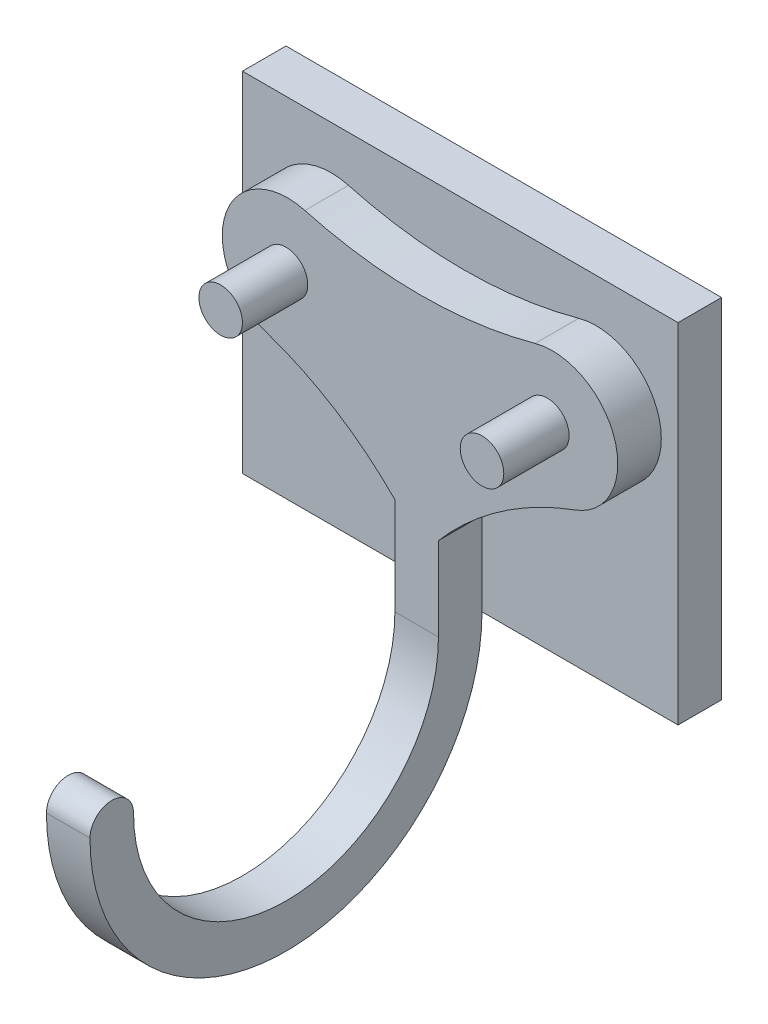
ISO-10303-21;
HEADER;
FILE_DESCRIPTION(('STEP AP214'),'2;1');
FILE_NAME('part.step','',(''),(''),'','','');
FILE_SCHEMA(('AUTOMOTIVE_DESIGN { 1 0 10303 214 1 1 1 1 }'));
ENDSEC;
DATA;
#1=APPLICATION_CONTEXT('core data for automotive mechanical design processes');
#2=APPLICATION_PROTOCOL_DEFINITION('international standard','automotive_design',2000,#1);
#3=PRODUCT_CONTEXT('',#1,'mechanical');
#4=PRODUCT('Part','Part','',(#3));
#5=PRODUCT_RELATED_PRODUCT_CATEGORY('part','',(#4));
#6=PRODUCT_DEFINITION_FORMATION('','',#4);
#7=PRODUCT_DEFINITION_CONTEXT('part definition',#1,'design');
#8=PRODUCT_DEFINITION('design','',#6,#7);
#9=PRODUCT_DEFINITION_SHAPE('','',#8);
#10=(LENGTH_UNIT() NAMED_UNIT(*) SI_UNIT(.MILLI.,.METRE.));
#11=(NAMED_UNIT(*) PLANE_ANGLE_UNIT() SI_UNIT($,.RADIAN.));
#12=(NAMED_UNIT(*) SI_UNIT($,.STERADIAN.) SOLID_ANGLE_UNIT());
#13=UNCERTAINTY_MEASURE_WITH_UNIT(LENGTH_MEASURE(1.E-05),#10,'distance_accuracy_value','');
#14=(GEOMETRIC_REPRESENTATION_CONTEXT(3) GLOBAL_UNCERTAINTY_ASSIGNED_CONTEXT((#13)) GLOBAL_UNIT_ASSIGNED_CONTEXT((#10,
#11,#12)) REPRESENTATION_CONTEXT('',''));
#15=CARTESIAN_POINT('',(0.,0.,0.));
#16=DIRECTION('',(0.,0.,1.));
#17=DIRECTION('',(1.,0.,0.));
#18=AXIS2_PLACEMENT_3D('',#15,#16,#17);
#19=CARTESIAN_POINT('',(-10.,-8.,2.));
#20=DIRECTION('',(0.,1.,0.));
#21=DIRECTION('',(0.,0.,1.));
#22=AXIS2_PLACEMENT_3D('',#19,#20,#21);
#23=PLANE('',#22);
#24=DIRECTION('',(-1.,0.,0.));
#25=VECTOR('',#24,1.);
#26=CARTESIAN_POINT('',(1.,-8.,2.));
#27=LINE('',#26,#25);
#28=CARTESIAN_POINT('',(1.,-8.,2.));
#29=VERTEX_POINT('',#28);
#30=CARTESIAN_POINT('',(-1.,-8.,2.));
#31=VERTEX_POINT('',#30);
#32=EDGE_CURVE('E168',#29,#31,#27,.T.);
#33=ORIENTED_EDGE('',*,*,#32,.T.);
#34=DIRECTION('',(1.,0.,0.));
#35=VECTOR('',#34,1.);
#36=CARTESIAN_POINT('',(-10.,-8.,2.));
#37=LINE('',#36,#35);
#38=CARTESIAN_POINT('',(-10.,-8.,2.));
#39=VERTEX_POINT('',#38);
#40=EDGE_CURVE('E229',#39,#31,#37,.T.);
#41=ORIENTED_EDGE('',*,*,#40,.F.);
#42=DIRECTION('',(0.,0.,-1.));
#43=VECTOR('',#42,1.);
#44=CARTESIAN_POINT('',(-10.,-8.,2.));
#45=LINE('',#44,#43);
#46=CARTESIAN_POINT('',(-10.,-8.,0.));
#47=VERTEX_POINT('',#46);
#48=EDGE_CURVE('E242',#39,#47,#45,.T.);
#49=ORIENTED_EDGE('',*,*,#48,.T.);
#50=DIRECTION('',(1.,0.,0.));
#51=VECTOR('',#50,1.);
#52=CARTESIAN_POINT('',(-10.,-8.,0.));
#53=LINE('',#52,#51);
#54=CARTESIAN_POINT('',(10.,-8.,0.));
#55=VERTEX_POINT('',#54);
#56=EDGE_CURVE('E224',#47,#55,#53,.T.);
#57=ORIENTED_EDGE('',*,*,#56,.T.);
#58=DIRECTION('',(0.,0.,-1.));
#59=VECTOR('',#58,1.);
#60=CARTESIAN_POINT('',(10.,-8.,2.));
#61=LINE('',#60,#59);
#62=CARTESIAN_POINT('',(10.,-8.,2.));
#63=VERTEX_POINT('',#62);
#64=EDGE_CURVE('E232',#63,#55,#61,.T.);
#65=ORIENTED_EDGE('',*,*,#64,.F.);
#66=EDGE_CURVE('E228',#29,#63,#37,.T.);
#67=ORIENTED_EDGE('',*,*,#66,.F.);
#68=EDGE_LOOP('',(#33,#41,#49,#57,#65,#67));
#69=FACE_BOUND('',#68,.T.);
#70=ADVANCED_FACE('F39',(#69),#23,.F.);
#71=CARTESIAN_POINT('',(10.,8.,2.));
#72=DIRECTION('',(-1.,0.,0.));
#73=DIRECTION('',(0.,0.,1.));
#74=AXIS2_PLACEMENT_3D('',#71,#72,#73);
#75=PLANE('',#74);
#76=DIRECTION('',(0.,1.,0.));
#77=VECTOR('',#76,1.);
#78=CARTESIAN_POINT('',(10.,8.,0.));
#79=LINE('',#78,#77);
#80=CARTESIAN_POINT('',(10.,8.,0.));
#81=VERTEX_POINT('',#80);
#82=EDGE_CURVE('E219',#55,#81,#79,.T.);
#83=ORIENTED_EDGE('',*,*,#82,.T.);
#84=DIRECTION('',(0.,0.,-1.));
#85=VECTOR('',#84,1.);
#86=CARTESIAN_POINT('',(10.,8.,2.));
#87=LINE('',#86,#85);
#88=CARTESIAN_POINT('',(10.,8.,2.));
#89=VERTEX_POINT('',#88);
#90=EDGE_CURVE('E248',#89,#81,#87,.T.);
#91=ORIENTED_EDGE('',*,*,#90,.F.);
#92=DIRECTION('',(0.,1.,0.));
#93=VECTOR('',#92,1.);
#94=CARTESIAN_POINT('',(10.,8.,2.));
#95=LINE('',#94,#93);
#96=EDGE_CURVE('E220',#63,#89,#95,.T.);
#97=ORIENTED_EDGE('',*,*,#96,.F.);
#98=ORIENTED_EDGE('',*,*,#64,.T.);
#99=EDGE_LOOP('',(#83,#91,#97,#98));
#100=FACE_BOUND('',#99,.T.);
#101=ADVANCED_FACE('F41',(#100),#75,.F.);
#102=CARTESIAN_POINT('',(-10.,8.,2.));
#103=DIRECTION('',(0.,-1.,0.));
#104=DIRECTION('',(0.,0.,-1.));
#105=AXIS2_PLACEMENT_3D('',#102,#103,#104);
#106=PLANE('',#105);
#107=DIRECTION('',(-1.,0.,0.));
#108=VECTOR('',#107,1.);
#109=CARTESIAN_POINT('',(-10.,8.,0.));
#110=LINE('',#109,#108);
#111=CARTESIAN_POINT('',(-10.,8.,0.));
#112=VERTEX_POINT('',#111);
#113=EDGE_CURVE('E235',#81,#112,#110,.T.);
#114=ORIENTED_EDGE('',*,*,#113,.T.);
#115=DIRECTION('',(0.,0.,-1.));
#116=VECTOR('',#115,1.);
#117=CARTESIAN_POINT('',(-10.,8.,2.));
#118=LINE('',#117,#116);
#119=CARTESIAN_POINT('',(-10.,8.,2.));
#120=VERTEX_POINT('',#119);
#121=EDGE_CURVE('E245',#120,#112,#118,.T.);
#122=ORIENTED_EDGE('',*,*,#121,.F.);
#123=DIRECTION('',(-1.,0.,0.));
#124=VECTOR('',#123,1.);
#125=CARTESIAN_POINT('',(-10.,8.,2.));
#126=LINE('',#125,#124);
#127=EDGE_CURVE('E223',#89,#120,#126,.T.);
#128=ORIENTED_EDGE('',*,*,#127,.F.);
#129=ORIENTED_EDGE('',*,*,#90,.T.);
#130=EDGE_LOOP('',(#114,#122,#128,#129));
#131=FACE_BOUND('',#130,.T.);
#132=ADVANCED_FACE('F297',(#131),#106,.F.);
#133=CARTESIAN_POINT('',(-10.,8.,2.));
#134=DIRECTION('',(1.,0.,0.));
#135=DIRECTION('',(0.,1.,0.));
#136=AXIS2_PLACEMENT_3D('',#133,#134,#135);
#137=PLANE('',#136);
#138=DIRECTION('',(0.,-1.,0.));
#139=VECTOR('',#138,1.);
#140=CARTESIAN_POINT('',(-10.,8.,0.));
#141=LINE('',#140,#139);
#142=EDGE_CURVE('E237',#112,#47,#141,.T.);
#143=ORIENTED_EDGE('',*,*,#142,.T.);
#144=ORIENTED_EDGE('',*,*,#48,.F.);
#145=DIRECTION('',(0.,-1.,0.));
#146=VECTOR('',#145,1.);
#147=CARTESIAN_POINT('',(-10.,8.,2.));
#148=LINE('',#147,#146);
#149=EDGE_CURVE('E226',#120,#39,#148,.T.);
#150=ORIENTED_EDGE('',*,*,#149,.F.);
#151=ORIENTED_EDGE('',*,*,#121,.T.);
#152=EDGE_LOOP('',(#143,#144,#150,#151));
#153=FACE_BOUND('',#152,.T.);
#154=ADVANCED_FACE('F300',(#153),#137,.F.);
#155=CARTESIAN_POINT('',(0.,0.,2.));
#156=DIRECTION('',(0.,0.,1.));
#157=DIRECTION('',(1.,0.,0.));
#158=AXIS2_PLACEMENT_3D('',#155,#156,#157);
#159=PLANE('',#158);
#160=DIRECTION('',(0.,1.,0.));
#161=VECTOR('',#160,1.);
#162=CARTESIAN_POINT('',(1.,-4.16639298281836,2.));
#163=LINE('',#162,#161);
#164=CARTESIAN_POINT('',(1.,-4.16639298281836,2.));
#165=VERTEX_POINT('',#164);
#166=EDGE_CURVE('E193',#29,#165,#163,.T.);
#167=ORIENTED_EDGE('',*,*,#166,.F.);
#168=ORIENTED_EDGE('',*,*,#66,.T.);
#169=ORIENTED_EDGE('',*,*,#96,.T.);
#170=ORIENTED_EDGE('',*,*,#127,.T.);
#171=ORIENTED_EDGE('',*,*,#149,.T.);
#172=ORIENTED_EDGE('',*,*,#40,.T.);
#173=DIRECTION('',(0.,-1.,0.));
#174=VECTOR('',#173,1.);
#175=CARTESIAN_POINT('',(-1.,-3.53874892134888,2.));
#176=LINE('',#175,#174);
#177=CARTESIAN_POINT('',(-1.,-3.53874892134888,2.));
#178=VERTEX_POINT('',#177);
#179=EDGE_CURVE('E166',#178,#31,#176,.T.);
#180=ORIENTED_EDGE('',*,*,#179,.F.);
#181=CARTESIAN_POINT('',(-11.7037915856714,-14.0472619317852,2.));
#182=DIRECTION('',(0.,0.,-1.));
#183=DIRECTION('',(-1.,0.,0.));
#184=AXIS2_PLACEMENT_3D('',#181,#182,#183);
#185=CIRCLE('',#184,15.);
#186=CARTESIAN_POINT('',(-6.88838945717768,0.158789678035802,2.));
#187=VERTEX_POINT('',#186);
#188=EDGE_CURVE('E163',#187,#178,#185,.T.);
#189=ORIENTED_EDGE('',*,*,#188,.F.);
#190=CARTESIAN_POINT('',(-5.92530903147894,3.,2.));
#191=DIRECTION('',(0.,0.,1.));
#192=DIRECTION('',(1.,0.,0.));
#193=AXIS2_PLACEMENT_3D('',#190,#191,#192);
#194=CIRCLE('',#193,3.);
#195=CARTESIAN_POINT('',(-5.13238751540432,5.89331565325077,2.));
#196=VERTEX_POINT('',#195);
#197=EDGE_CURVE('E176',#196,#187,#194,.T.);
#198=ORIENTED_EDGE('',*,*,#197,.F.);
#199=CARTESIAN_POINT('',(0.153755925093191,25.1820866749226,2.));
#200=DIRECTION('',(0.,0.,-1.));
#201=DIRECTION('',(1.,0.,0.));
#202=AXIS2_PLACEMENT_3D('',#199,#200,#201);
#203=CIRCLE('',#202,20.);
#204=CARTESIAN_POINT('',(5.43989936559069,5.89331565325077,2.));
#205=VERTEX_POINT('',#204);
#206=EDGE_CURVE('E197',#205,#196,#203,.T.);
#207=ORIENTED_EDGE('',*,*,#206,.F.);
#208=CARTESIAN_POINT('',(6.23282088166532,3.,2.));
#209=DIRECTION('',(0.,0.,1.));
#210=DIRECTION('',(1.,0.,0.));
#211=AXIS2_PLACEMENT_3D('',#208,#209,#210);
#212=CIRCLE('',#211,3.);
#213=CARTESIAN_POINT('',(7.26165955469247,0.181934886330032,2.));
#214=VERTEX_POINT('',#213);
#215=EDGE_CURVE('E59',#214,#205,#212,.T.);
#216=ORIENTED_EDGE('',*,*,#215,.F.);
#217=CARTESIAN_POINT('',(12.4058529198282,-13.9083906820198,2.));
#218=DIRECTION('',(0.,0.,-1.));
#219=DIRECTION('',(1.,0.,0.));
#220=AXIS2_PLACEMENT_3D('',#217,#218,#219);
#221=CIRCLE('',#220,15.);
#222=EDGE_CURVE('E54',#165,#214,#221,.T.);
#223=ORIENTED_EDGE('',*,*,#222,.F.);
#224=EDGE_LOOP('',(#167,#168,#169,#170,#171,#172,#180,#189,#198,#207,#216,#223));
#225=FACE_BOUND('',#224,.T.);
#226=ADVANCED_FACE('F286',(#225),#159,.T.);
#227=CARTESIAN_POINT('',(0.,0.,0.));
#228=DIRECTION('',(0.,0.,1.));
#229=DIRECTION('',(1.,0.,0.));
#230=AXIS2_PLACEMENT_3D('',#227,#228,#229);
#231=PLANE('',#230);
#232=ORIENTED_EDGE('',*,*,#82,.F.);
#233=ORIENTED_EDGE('',*,*,#56,.F.);
#234=ORIENTED_EDGE('',*,*,#142,.F.);
#235=ORIENTED_EDGE('',*,*,#113,.F.);
#236=EDGE_LOOP('',(#232,#233,#234,#235));
#237=FACE_BOUND('',#236,.T.);
#238=ADVANCED_FACE('F332',(#237),#231,.F.);
#239=CARTESIAN_POINT('',(-11.7037915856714,-14.0472619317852,4.));
#240=DIRECTION('',(0.,0.,-1.));
#241=DIRECTION('',(-1.,0.,0.));
#242=AXIS2_PLACEMENT_3D('',#239,#240,#241);
#243=CYLINDRICAL_SURFACE('',#242,15.);
#244=ORIENTED_EDGE('',*,*,#188,.T.);
#245=DIRECTION('',(0.,0.,-1.));
#246=VECTOR('',#245,1.);
#247=CARTESIAN_POINT('',(-1.,-3.53874892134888,4.));
#248=LINE('',#247,#246);
#249=CARTESIAN_POINT('',(-1.,-3.53874892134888,4.));
#250=VERTEX_POINT('',#249);
#251=EDGE_CURVE('E216',#250,#178,#248,.T.);
#252=ORIENTED_EDGE('',*,*,#251,.F.);
#253=CARTESIAN_POINT('',(-11.7037915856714,-14.0472619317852,4.));
#254=DIRECTION('',(0.,0.,-1.));
#255=DIRECTION('',(-1.,0.,0.));
#256=AXIS2_PLACEMENT_3D('',#253,#254,#255);
#257=CIRCLE('',#256,15.);
#258=CARTESIAN_POINT('',(-6.88838945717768,0.158789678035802,4.));
#259=VERTEX_POINT('',#258);
#260=EDGE_CURVE('E172',#259,#250,#257,.T.);
#261=ORIENTED_EDGE('',*,*,#260,.F.);
#262=DIRECTION('',(0.,0.,-1.));
#263=VECTOR('',#262,1.);
#264=CARTESIAN_POINT('',(-6.88838945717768,0.158789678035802,4.));
#265=LINE('',#264,#263);
#266=EDGE_CURVE('E189',#259,#187,#265,.T.);
#267=ORIENTED_EDGE('',*,*,#266,.T.);
#268=EDGE_LOOP('',(#244,#252,#261,#267));
#269=FACE_BOUND('',#268,.T.);
#270=ADVANCED_FACE('F266',(#269),#243,.F.);
#271=CARTESIAN_POINT('',(-1.,-3.53874892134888,4.));
#272=DIRECTION('',(1.,0.,0.));
#273=DIRECTION('',(0.,1.,0.));
#274=AXIS2_PLACEMENT_3D('',#271,#272,#273);
#275=PLANE('',#274);
#276=ORIENTED_EDGE('',*,*,#179,.T.);
#277=CARTESIAN_POINT('',(-1.,-8.,11.));
#278=DIRECTION('',(1.,0.,0.));
#279=DIRECTION('',(0.,0.,-1.));
#280=AXIS2_PLACEMENT_3D('',#277,#278,#279);
#281=CIRCLE('',#280,9.);
#282=CARTESIAN_POINT('',(-1.,-7.99999999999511,20.));
#283=VERTEX_POINT('',#282);
#284=EDGE_CURVE('E158',#283,#31,#281,.T.);
#285=ORIENTED_EDGE('',*,*,#284,.F.);
#286=CARTESIAN_POINT('',(-1.,-7.99999999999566,19.));
#287=DIRECTION('',(1.,0.,0.));
#288=DIRECTION('',(0.,0.,-1.));
#289=AXIS2_PLACEMENT_3D('',#286,#287,#288);
#290=CIRCLE('',#289,1.);
#291=CARTESIAN_POINT('',(-1.,-7.9999999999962,18.));
#292=VERTEX_POINT('',#291);
#293=EDGE_CURVE('E270',#292,#283,#290,.T.);
#294=ORIENTED_EDGE('',*,*,#293,.F.);
#295=CARTESIAN_POINT('',(-1.,-8.,11.));
#296=DIRECTION('',(-1.,0.,0.));
#297=DIRECTION('',(0.,0.,-1.));
#298=AXIS2_PLACEMENT_3D('',#295,#296,#297);
#299=CIRCLE('',#298,7.);
#300=CARTESIAN_POINT('',(-1.,-8.,4.));
#301=VERTEX_POINT('',#300);
#302=EDGE_CURVE('E162',#301,#292,#299,.T.);
#303=ORIENTED_EDGE('',*,*,#302,.F.);
#304=DIRECTION('',(0.,-1.,0.));
#305=VECTOR('',#304,1.);
#306=CARTESIAN_POINT('',(-1.,-3.53874892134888,4.));
#307=LINE('',#306,#305);
#308=EDGE_CURVE('E175',#250,#301,#307,.T.);
#309=ORIENTED_EDGE('',*,*,#308,.F.);
#310=ORIENTED_EDGE('',*,*,#251,.T.);
#311=EDGE_LOOP('',(#276,#285,#294,#303,#309,#310));
#312=FACE_BOUND('',#311,.T.);
#313=ADVANCED_FACE('F268',(#312),#275,.F.);
#314=CARTESIAN_POINT('',(1.,-4.16639298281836,4.));
#315=DIRECTION('',(-1.,0.,0.));
#316=DIRECTION('',(0.,-1.,0.));
#317=AXIS2_PLACEMENT_3D('',#314,#315,#316);
#318=PLANE('',#317);
#319=ORIENTED_EDGE('',*,*,#166,.T.);
#320=DIRECTION('',(0.,0.,-1.));
#321=VECTOR('',#320,1.);
#322=CARTESIAN_POINT('',(1.,-4.16639298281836,4.));
#323=LINE('',#322,#321);
#324=CARTESIAN_POINT('',(1.,-4.16639298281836,4.));
#325=VERTEX_POINT('',#324);
#326=EDGE_CURVE('E213',#325,#165,#323,.T.);
#327=ORIENTED_EDGE('',*,*,#326,.F.);
#328=DIRECTION('',(0.,1.,0.));
#329=VECTOR('',#328,1.);
#330=CARTESIAN_POINT('',(1.,-4.16639298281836,4.));
#331=LINE('',#330,#329);
#332=CARTESIAN_POINT('',(1.,-8.,4.));
#333=VERTEX_POINT('',#332);
#334=EDGE_CURVE('E155',#333,#325,#331,.T.);
#335=ORIENTED_EDGE('',*,*,#334,.F.);
#336=CARTESIAN_POINT('',(1.,-8.,11.));
#337=DIRECTION('',(-1.,0.,0.));
#338=DIRECTION('',(0.,0.,-1.));
#339=AXIS2_PLACEMENT_3D('',#336,#337,#338);
#340=CIRCLE('',#339,7.);
#341=CARTESIAN_POINT('',(1.,-7.9999999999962,18.));
#342=VERTEX_POINT('',#341);
#343=EDGE_CURVE('E150',#333,#342,#340,.T.);
#344=ORIENTED_EDGE('',*,*,#343,.T.);
#345=CARTESIAN_POINT('',(1.,-7.99999999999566,19.));
#346=DIRECTION('',(1.,0.,0.));
#347=DIRECTION('',(0.,0.,-1.));
#348=AXIS2_PLACEMENT_3D('',#345,#346,#347);
#349=CIRCLE('',#348,1.);
#350=CARTESIAN_POINT('',(1.,-7.99999999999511,20.));
#351=VERTEX_POINT('',#350);
#352=EDGE_CURVE('E139',#342,#351,#349,.T.);
#353=ORIENTED_EDGE('',*,*,#352,.T.);
#354=CARTESIAN_POINT('',(1.,-8.,11.));
#355=DIRECTION('',(1.,0.,0.));
#356=DIRECTION('',(0.,0.,-1.));
#357=AXIS2_PLACEMENT_3D('',#354,#355,#356);
#358=CIRCLE('',#357,9.);
#359=EDGE_CURVE('E149',#351,#29,#358,.T.);
#360=ORIENTED_EDGE('',*,*,#359,.T.);
#361=EDGE_LOOP('',(#319,#327,#335,#344,#353,#360));
#362=FACE_BOUND('',#361,.T.);
#363=ADVANCED_FACE('F153',(#362),#318,.F.);
#364=CARTESIAN_POINT('',(12.4058529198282,-13.9083906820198,4.));
#365=DIRECTION('',(0.,0.,-1.));
#366=DIRECTION('',(-1.,0.,0.));
#367=AXIS2_PLACEMENT_3D('',#364,#365,#366);
#368=CYLINDRICAL_SURFACE('',#367,15.);
#369=ORIENTED_EDGE('',*,*,#222,.T.);
#370=DIRECTION('',(0.,0.,-1.));
#371=VECTOR('',#370,1.);
#372=CARTESIAN_POINT('',(7.26165955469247,0.181934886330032,4.));
#373=LINE('',#372,#371);
#374=CARTESIAN_POINT('',(7.26165955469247,0.181934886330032,4.));
#375=VERTEX_POINT('',#374);
#376=EDGE_CURVE('E210',#375,#214,#373,.T.);
#377=ORIENTED_EDGE('',*,*,#376,.F.);
#378=CARTESIAN_POINT('',(12.4058529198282,-13.9083906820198,4.));
#379=DIRECTION('',(0.,0.,-1.));
#380=DIRECTION('',(1.,0.,0.));
#381=AXIS2_PLACEMENT_3D('',#378,#379,#380);
#382=CIRCLE('',#381,15.);
#383=EDGE_CURVE('E182',#325,#375,#382,.T.);
#384=ORIENTED_EDGE('',*,*,#383,.F.);
#385=ORIENTED_EDGE('',*,*,#326,.T.);
#386=EDGE_LOOP('',(#369,#377,#384,#385));
#387=FACE_BOUND('',#386,.T.);
#388=ADVANCED_FACE('F313',(#387),#368,.F.);
#389=CARTESIAN_POINT('',(6.23282088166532,3.,4.));
#390=DIRECTION('',(0.,0.,-1.));
#391=DIRECTION('',(-1.,0.,0.));
#392=AXIS2_PLACEMENT_3D('',#389,#390,#391);
#393=CYLINDRICAL_SURFACE('',#392,3.);
#394=ORIENTED_EDGE('',*,*,#215,.T.);
#395=DIRECTION('',(0.,0.,-1.));
#396=VECTOR('',#395,1.);
#397=CARTESIAN_POINT('',(5.43989936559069,5.89331565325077,4.));
#398=LINE('',#397,#396);
#399=CARTESIAN_POINT('',(5.43989936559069,5.89331565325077,4.));
#400=VERTEX_POINT('',#399);
#401=EDGE_CURVE('E207',#400,#205,#398,.T.);
#402=ORIENTED_EDGE('',*,*,#401,.F.);
#403=CARTESIAN_POINT('',(6.23282088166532,3.,4.));
#404=DIRECTION('',(0.,0.,1.));
#405=DIRECTION('',(1.,0.,0.));
#406=AXIS2_PLACEMENT_3D('',#403,#404,#405);
#407=CIRCLE('',#406,3.);
#408=EDGE_CURVE('E184',#375,#400,#407,.T.);
#409=ORIENTED_EDGE('',*,*,#408,.F.);
#410=ORIENTED_EDGE('',*,*,#376,.T.);
#411=EDGE_LOOP('',(#394,#402,#409,#410));
#412=FACE_BOUND('',#411,.T.);
#413=ADVANCED_FACE('F308',(#412),#393,.T.);
#414=CARTESIAN_POINT('',(0.153755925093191,25.1820866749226,4.));
#415=DIRECTION('',(0.,0.,-1.));
#416=DIRECTION('',(-1.,0.,0.));
#417=AXIS2_PLACEMENT_3D('',#414,#415,#416);
#418=CYLINDRICAL_SURFACE('',#417,20.);
#419=ORIENTED_EDGE('',*,*,#206,.T.);
#420=DIRECTION('',(0.,0.,-1.));
#421=VECTOR('',#420,1.);
#422=CARTESIAN_POINT('',(-5.13238751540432,5.89331565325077,4.));
#423=LINE('',#422,#421);
#424=CARTESIAN_POINT('',(-5.13238751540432,5.89331565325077,4.));
#425=VERTEX_POINT('',#424);
#426=EDGE_CURVE('E204',#425,#196,#423,.T.);
#427=ORIENTED_EDGE('',*,*,#426,.F.);
#428=CARTESIAN_POINT('',(0.153755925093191,25.1820866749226,4.));
#429=DIRECTION('',(0.,0.,-1.));
#430=DIRECTION('',(1.,0.,0.));
#431=AXIS2_PLACEMENT_3D('',#428,#429,#430);
#432=CIRCLE('',#431,20.);
#433=EDGE_CURVE('E186',#400,#425,#432,.T.);
#434=ORIENTED_EDGE('',*,*,#433,.F.);
#435=ORIENTED_EDGE('',*,*,#401,.T.);
#436=EDGE_LOOP('',(#419,#427,#434,#435));
#437=FACE_BOUND('',#436,.T.);
#438=ADVANCED_FACE('F305',(#437),#418,.F.);
#439=CARTESIAN_POINT('',(-5.92530903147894,3.,4.));
#440=DIRECTION('',(0.,0.,-1.));
#441=DIRECTION('',(-1.,0.,0.));
#442=AXIS2_PLACEMENT_3D('',#439,#440,#441);
#443=CYLINDRICAL_SURFACE('',#442,3.);
#444=ORIENTED_EDGE('',*,*,#197,.T.);
#445=ORIENTED_EDGE('',*,*,#266,.F.);
#446=CARTESIAN_POINT('',(-5.92530903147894,3.,4.));
#447=DIRECTION('',(0.,0.,1.));
#448=DIRECTION('',(1.,0.,0.));
#449=AXIS2_PLACEMENT_3D('',#446,#447,#448);
#450=CIRCLE('',#449,3.);
#451=EDGE_CURVE('E188',#425,#259,#450,.T.);
#452=ORIENTED_EDGE('',*,*,#451,.F.);
#453=ORIENTED_EDGE('',*,*,#426,.T.);
#454=EDGE_LOOP('',(#444,#445,#452,#453));
#455=FACE_BOUND('',#454,.T.);
#456=ADVANCED_FACE('F258',(#455),#443,.T.);
#457=CARTESIAN_POINT('',(-11.7037915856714,-14.0472619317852,4.));
#458=DIRECTION('',(0.,0.,-1.));
#459=DIRECTION('',(-1.,0.,0.));
#460=AXIS2_PLACEMENT_3D('',#457,#458,#459);
#461=PLANE('',#460);
#462=CARTESIAN_POINT('',(-6.,3.,4.));
#463=DIRECTION('',(0.,0.,-1.));
#464=DIRECTION('',(-1.,0.,0.));
#465=AXIS2_PLACEMENT_3D('',#462,#463,#464);
#466=CIRCLE('',#465,1.);
#467=CARTESIAN_POINT('',(-7.,3.,4.));
#468=VERTEX_POINT('',#467);
#469=EDGE_CURVE('E11',#468,#468,#466,.F.);
#470=ORIENTED_EDGE('',*,*,#469,.F.);
#471=EDGE_LOOP('',(#470));
#472=FACE_BOUND('',#471,.T.);
#473=CARTESIAN_POINT('',(6.,3.,4.));
#474=DIRECTION('',(0.,0.,-1.));
#475=DIRECTION('',(-1.,0.,0.));
#476=AXIS2_PLACEMENT_3D('',#473,#474,#475);
#477=CIRCLE('',#476,1.);
#478=CARTESIAN_POINT('',(5.,3.,4.));
#479=VERTEX_POINT('',#478);
#480=EDGE_CURVE('E47',#479,#479,#477,.F.);
#481=ORIENTED_EDGE('',*,*,#480,.F.);
#482=EDGE_LOOP('',(#481));
#483=FACE_BOUND('',#482,.T.);
#484=ORIENTED_EDGE('',*,*,#260,.T.);
#485=ORIENTED_EDGE('',*,*,#308,.T.);
#486=DIRECTION('',(1.,0.,0.));
#487=VECTOR('',#486,1.);
#488=CARTESIAN_POINT('',(-0.999999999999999,-8.,4.));
#489=LINE('',#488,#487);
#490=EDGE_CURVE('E179',#301,#333,#489,.T.);
#491=ORIENTED_EDGE('',*,*,#490,.T.);
#492=ORIENTED_EDGE('',*,*,#334,.T.);
#493=ORIENTED_EDGE('',*,*,#383,.T.);
#494=ORIENTED_EDGE('',*,*,#408,.T.);
#495=ORIENTED_EDGE('',*,*,#433,.T.);
#496=ORIENTED_EDGE('',*,*,#451,.T.);
#497=EDGE_LOOP('',(#484,#485,#491,#492,#493,#494,#495,#496));
#498=FACE_BOUND('',#497,.T.);
#499=ADVANCED_FACE('F255',(#472,#483,#498),#461,.F.);
#500=CARTESIAN_POINT('',(1.,-8.,11.));
#501=DIRECTION('',(-1.,0.,0.));
#502=DIRECTION('',(0.,0.,1.));
#503=AXIS2_PLACEMENT_3D('',#500,#501,#502);
#504=CYLINDRICAL_SURFACE('',#503,7.);
#505=ORIENTED_EDGE('',*,*,#302,.T.);
#506=DIRECTION('',(-1.,0.,0.));
#507=VECTOR('',#506,1.);
#508=CARTESIAN_POINT('',(1.,-7.9999999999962,18.));
#509=LINE('',#508,#507);
#510=EDGE_CURVE('E143',#342,#292,#509,.T.);
#511=ORIENTED_EDGE('',*,*,#510,.F.);
#512=ORIENTED_EDGE('',*,*,#343,.F.);
#513=ORIENTED_EDGE('',*,*,#490,.F.);
#514=EDGE_LOOP('',(#505,#511,#512,#513));
#515=FACE_BOUND('',#514,.T.);
#516=ADVANCED_FACE('F160',(#515),#504,.F.);
#517=CARTESIAN_POINT('',(1.,-7.99999999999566,19.));
#518=DIRECTION('',(-1.,0.,0.));
#519=DIRECTION('',(0.,0.,1.));
#520=AXIS2_PLACEMENT_3D('',#517,#518,#519);
#521=CYLINDRICAL_SURFACE('',#520,1.);
#522=ORIENTED_EDGE('',*,*,#293,.T.);
#523=DIRECTION('',(-1.,0.,0.));
#524=VECTOR('',#523,1.);
#525=CARTESIAN_POINT('',(1.,-7.99999999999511,20.));
#526=LINE('',#525,#524);
#527=EDGE_CURVE('E146',#351,#283,#526,.T.);
#528=ORIENTED_EDGE('',*,*,#527,.F.);
#529=ORIENTED_EDGE('',*,*,#352,.F.);
#530=ORIENTED_EDGE('',*,*,#510,.T.);
#531=EDGE_LOOP('',(#522,#528,#529,#530));
#532=FACE_BOUND('',#531,.T.);
#533=ADVANCED_FACE('F141',(#532),#521,.T.);
#534=CARTESIAN_POINT('',(1.,-8.,11.));
#535=DIRECTION('',(-1.,0.,0.));
#536=DIRECTION('',(0.,0.,1.));
#537=AXIS2_PLACEMENT_3D('',#534,#535,#536);
#538=CYLINDRICAL_SURFACE('',#537,9.);
#539=ORIENTED_EDGE('',*,*,#284,.T.);
#540=ORIENTED_EDGE('',*,*,#32,.F.);
#541=ORIENTED_EDGE('',*,*,#359,.F.);
#542=ORIENTED_EDGE('',*,*,#527,.T.);
#543=EDGE_LOOP('',(#539,#540,#541,#542));
#544=FACE_BOUND('',#543,.T.);
#545=ADVANCED_FACE('F285',(#544),#538,.T.);
#546=CARTESIAN_POINT('',(6.,3.,7.));
#547=DIRECTION('',(0.,0.,-1.));
#548=DIRECTION('',(-1.,0.,0.));
#549=AXIS2_PLACEMENT_3D('',#546,#547,#548);
#550=CYLINDRICAL_SURFACE('',#549,1.);
#551=CARTESIAN_POINT('',(6.,3.,7.));
#552=DIRECTION('',(0.,0.,1.));
#553=DIRECTION('',(1.,0.,0.));
#554=AXIS2_PLACEMENT_3D('',#551,#552,#553);
#555=CIRCLE('',#554,1.);
#556=CARTESIAN_POINT('',(7.,3.,7.));
#557=VERTEX_POINT('',#556);
#558=EDGE_CURVE('E275',#557,#557,#555,.T.);
#559=ORIENTED_EDGE('',*,*,#558,.F.);
#560=EDGE_LOOP('',(#559));
#561=FACE_BOUND('',#560,.T.);
#562=ORIENTED_EDGE('',*,*,#480,.T.);
#563=EDGE_LOOP('',(#562));
#564=FACE_BOUND('',#563,.T.);
#565=ADVANCED_FACE('F253',(#561,#564),#550,.T.);
#566=CARTESIAN_POINT('',(6.,3.,7.));
#567=DIRECTION('',(0.,0.,1.));
#568=DIRECTION('',(1.,0.,0.));
#569=AXIS2_PLACEMENT_3D('',#566,#567,#568);
#570=PLANE('',#569);
#571=ORIENTED_EDGE('',*,*,#558,.T.);
#572=EDGE_LOOP('',(#571));
#573=FACE_BOUND('',#572,.T.);
#574=ADVANCED_FACE('F445',(#573),#570,.T.);
#575=CARTESIAN_POINT('',(-6.,3.,7.));
#576=DIRECTION('',(0.,0.,-1.));
#577=DIRECTION('',(-1.,0.,0.));
#578=AXIS2_PLACEMENT_3D('',#575,#576,#577);
#579=CYLINDRICAL_SURFACE('',#578,1.);
#580=CARTESIAN_POINT('',(-6.,3.,7.));
#581=DIRECTION('',(0.,0.,1.));
#582=DIRECTION('',(1.,0.,0.));
#583=AXIS2_PLACEMENT_3D('',#580,#581,#582);
#584=CIRCLE('',#583,1.);
#585=CARTESIAN_POINT('',(-5.,3.,7.));
#586=VERTEX_POINT('',#585);
#587=EDGE_CURVE('E271',#586,#586,#584,.T.);
#588=ORIENTED_EDGE('',*,*,#587,.F.);
#589=EDGE_LOOP('',(#588));
#590=FACE_BOUND('',#589,.T.);
#591=ORIENTED_EDGE('',*,*,#469,.T.);
#592=EDGE_LOOP('',(#591));
#593=FACE_BOUND('',#592,.T.);
#594=ADVANCED_FACE('F454',(#590,#593),#579,.T.);
#595=CARTESIAN_POINT('',(-6.,3.,7.));
#596=DIRECTION('',(0.,0.,1.));
#597=DIRECTION('',(1.,0.,0.));
#598=AXIS2_PLACEMENT_3D('',#595,#596,#597);
#599=PLANE('',#598);
#600=ORIENTED_EDGE('',*,*,#587,.T.);
#601=EDGE_LOOP('',(#600));
#602=FACE_BOUND('',#601,.T.);
#603=ADVANCED_FACE('F463',(#602),#599,.T.);
#604=CLOSED_SHELL('',(#70,#101,#132,#154,#226,#238,#270,#313,#363,#388,#413,#438,#456,#499,#516,
#533,#545,#565,#574,#594,#603));
#605=MANIFOLD_SOLID_BREP('B2',#604);
#606=ADVANCED_BREP_SHAPE_REPRESENTATION('',(#18,#605),#14);
#607=SHAPE_DEFINITION_REPRESENTATION(#9,#606);
ENDSEC;
END-ISO-10303-21;
